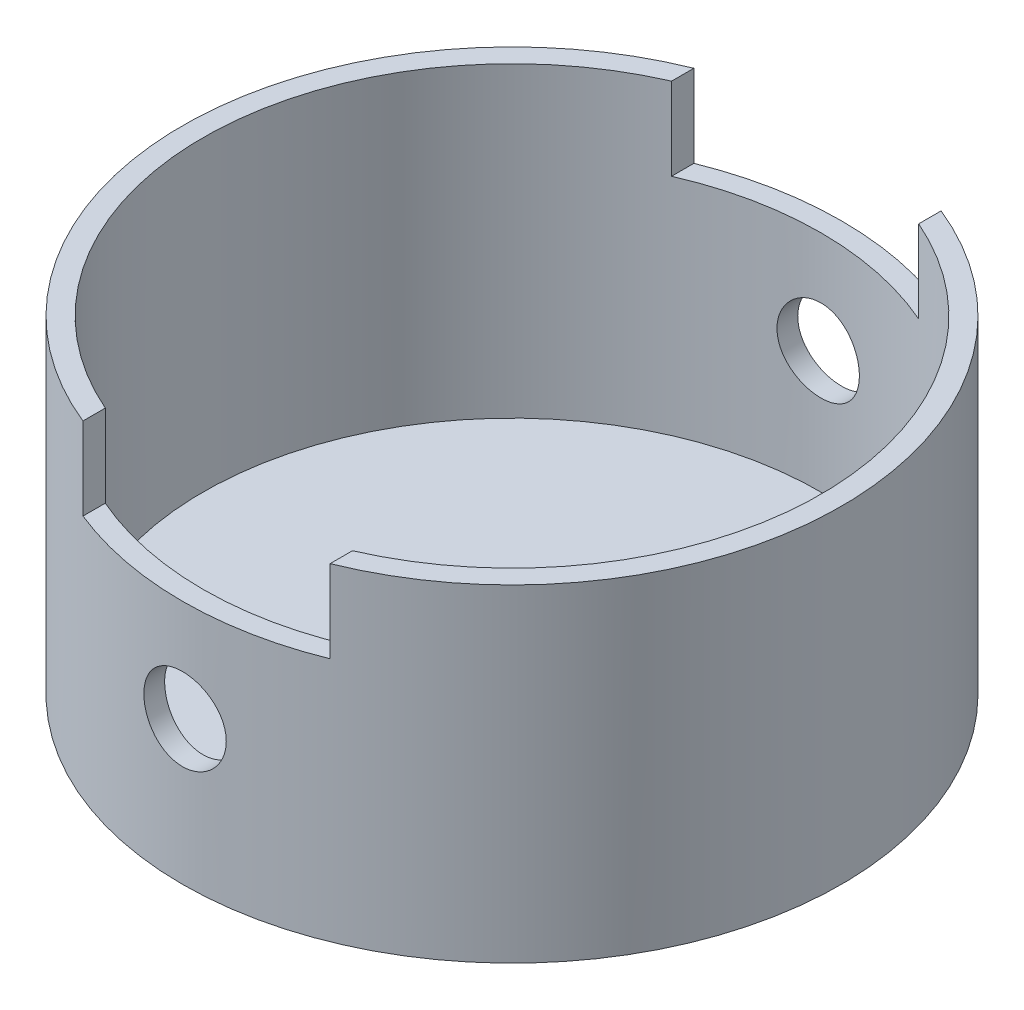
from build123d import *

# Parameters (mm, degrees)
SKETCH1_R           = 50.8
EXTRUDE1_DEPTH      = 50.4952
SHELL1_T            = -3.175
EXTRUDE2_DEPTH      = 88.81255732
EXTRUDE2_DEPTH_BACK = 88.81255732
SKETCH2_W           = 38.1
SKETCH2_H           = 12.7
EXTRUDE3_DEPTH      = 88.81255732
EXTRUDE3_DEPTH_BACK = 88.81255732
SKETCH3_R           = 6.35


with BuildPart() as part:
    # Sketch1 → Extrude1 (new body)
    with BuildSketch(Plane(origin=(0, 0, 0), x_dir=(1, 0, 0), z_dir=(0, 1, 0))):
        with Locations(Location((0, 0, 0), (0, 0, 270))):
            Circle(SKETCH1_R)
    extrude(amount=EXTRUDE1_DEPTH)

    # Shell1
    shell1_openings = [part.faces().sort_by_distance(p)[0] for p in [
        (0, 50.4952, 0),
    ]]
    offset(amount=SHELL1_T, openings=shell1_openings, kind=Kind.INTERSECTION)

    # Sketch2 → Extrude2 (cut, two sides: drawn at the far end of the back side and taken through both)
    with BuildSketch(Plane.XY.offset(-EXTRUDE2_DEPTH_BACK)):
        with Locations((0, 44.1452)):
            Rectangle(SKETCH2_W, SKETCH2_H)
    extrude(amount=EXTRUDE2_DEPTH + EXTRUDE2_DEPTH_BACK, mode=Mode.SUBTRACT)

    # Sketch3 → Extrude3 (cut, two sides: drawn at the far end of the back side and taken through both)
    with BuildSketch(Plane.XY.offset(-EXTRUDE3_DEPTH_BACK)):
        with Locations((0, 22.0726)):
            Circle(SKETCH3_R)
    extrude(amount=EXTRUDE3_DEPTH + EXTRUDE3_DEPTH_BACK, mode=Mode.SUBTRACT)


solid = part.part
